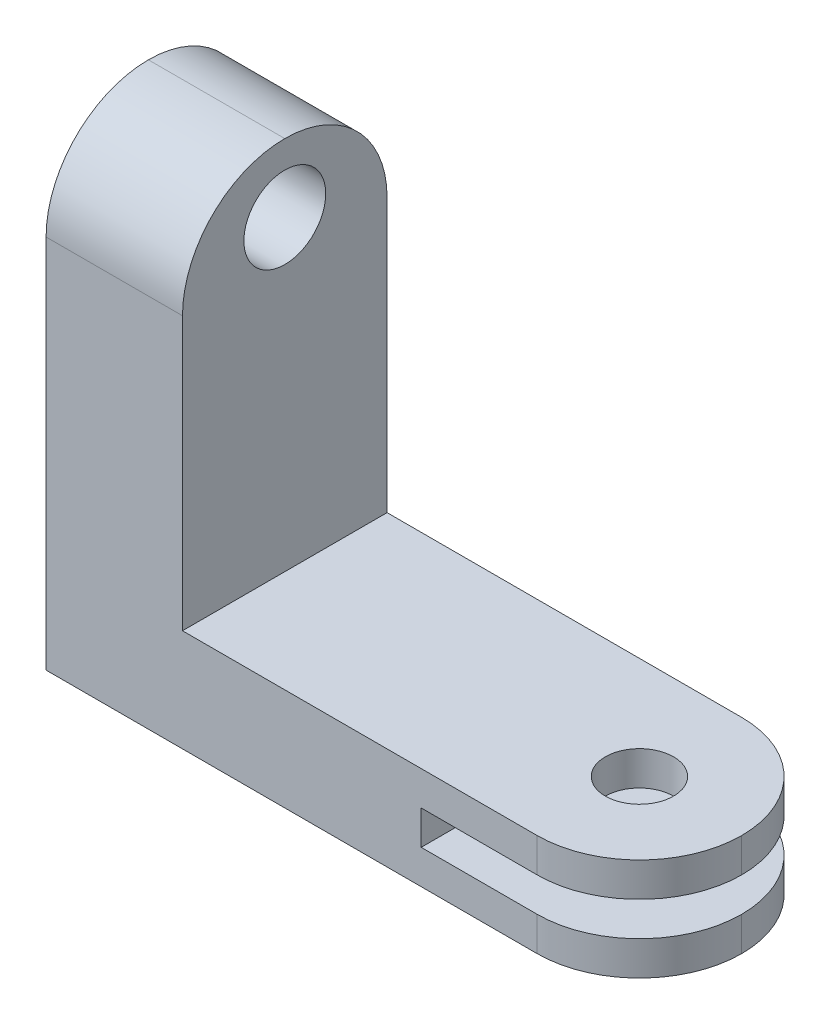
ISO-10303-21;
HEADER;
FILE_DESCRIPTION(('STEP AP214'),'2;1');
FILE_NAME('part.step','',(''),(''),'','','');
FILE_SCHEMA(('AUTOMOTIVE_DESIGN { 1 0 10303 214 1 1 1 1 }'));
ENDSEC;
DATA;
#1=APPLICATION_CONTEXT('core data for automotive mechanical design processes');
#2=APPLICATION_PROTOCOL_DEFINITION('international standard','automotive_design',2000,#1);
#3=PRODUCT_CONTEXT('',#1,'mechanical');
#4=PRODUCT('Part','Part','',(#3));
#5=PRODUCT_RELATED_PRODUCT_CATEGORY('part','',(#4));
#6=PRODUCT_DEFINITION_FORMATION('','',#4);
#7=PRODUCT_DEFINITION_CONTEXT('part definition',#1,'design');
#8=PRODUCT_DEFINITION('design','',#6,#7);
#9=PRODUCT_DEFINITION_SHAPE('','',#8);
#10=(LENGTH_UNIT() NAMED_UNIT(*) SI_UNIT(.MILLI.,.METRE.));
#11=(NAMED_UNIT(*) PLANE_ANGLE_UNIT() SI_UNIT($,.RADIAN.));
#12=(NAMED_UNIT(*) SI_UNIT($,.STERADIAN.) SOLID_ANGLE_UNIT());
#13=UNCERTAINTY_MEASURE_WITH_UNIT(LENGTH_MEASURE(1.E-05),#10,'distance_accuracy_value','');
#14=(GEOMETRIC_REPRESENTATION_CONTEXT(3) GLOBAL_UNCERTAINTY_ASSIGNED_CONTEXT((#13)) GLOBAL_UNIT_ASSIGNED_CONTEXT((#10,
#11,#12)) REPRESENTATION_CONTEXT('',''));
#15=CARTESIAN_POINT('',(0.,0.,0.));
#16=DIRECTION('',(0.,0.,1.));
#17=DIRECTION('',(1.,0.,0.));
#18=AXIS2_PLACEMENT_3D('',#15,#16,#17);
#19=CARTESIAN_POINT('',(72.,0.,15.));
#20=DIRECTION('',(0.,1.,0.));
#21=DIRECTION('',(0.,0.,1.));
#22=AXIS2_PLACEMENT_3D('',#19,#20,#21);
#23=CYLINDRICAL_SURFACE('',#22,15.);
#24=DIRECTION('',(0.,1.,0.));
#25=VECTOR('',#24,1.);
#26=CARTESIAN_POINT('',(87.,0.,15.));
#27=LINE('',#26,#25);
#28=CARTESIAN_POINT('',(87.,10.,15.));
#29=VERTEX_POINT('',#28);
#30=CARTESIAN_POINT('',(87.,15.,15.));
#31=VERTEX_POINT('',#30);
#32=EDGE_CURVE('E173',#29,#31,#27,.T.);
#33=ORIENTED_EDGE('',*,*,#32,.F.);
#34=CARTESIAN_POINT('',(72.,10.,15.));
#35=DIRECTION('',(0.,-1.,0.));
#36=DIRECTION('',(1.,0.,0.));
#37=AXIS2_PLACEMENT_3D('',#34,#35,#36);
#38=CIRCLE('',#37,15.);
#39=CARTESIAN_POINT('',(72.,10.,0.));
#40=VERTEX_POINT('',#39);
#41=EDGE_CURVE('E43',#29,#40,#38,.F.);
#42=ORIENTED_EDGE('',*,*,#41,.T.);
#43=DIRECTION('',(0.,1.,0.));
#44=VECTOR('',#43,1.);
#45=CARTESIAN_POINT('',(72.,0.,0.));
#46=LINE('',#45,#44);
#47=CARTESIAN_POINT('',(72.,15.,0.));
#48=VERTEX_POINT('',#47);
#49=EDGE_CURVE('E215',#48,#40,#46,.F.);
#50=ORIENTED_EDGE('',*,*,#49,.F.);
#51=CARTESIAN_POINT('',(72.,15.,15.));
#52=DIRECTION('',(0.,-1.,0.));
#53=DIRECTION('',(1.,0.,0.));
#54=AXIS2_PLACEMENT_3D('',#51,#52,#53);
#55=CIRCLE('',#54,15.);
#56=EDGE_CURVE('E205',#31,#48,#55,.F.);
#57=ORIENTED_EDGE('',*,*,#56,.F.);
#58=EDGE_LOOP('',(#33,#42,#50,#57));
#59=FACE_BOUND('',#58,.T.);
#60=ADVANCED_FACE('F26',(#59),#23,.T.);
#61=CARTESIAN_POINT('',(72.,0.,15.));
#62=DIRECTION('',(0.,-1.,0.));
#63=DIRECTION('',(0.,0.,-1.));
#64=AXIS2_PLACEMENT_3D('',#61,#62,#63);
#65=CYLINDRICAL_SURFACE('',#64,15.);
#66=DIRECTION('',(0.,1.,0.));
#67=VECTOR('',#66,1.);
#68=CARTESIAN_POINT('',(72.,15.,30.));
#69=LINE('',#68,#67);
#70=CARTESIAN_POINT('',(72.,10.,30.));
#71=VERTEX_POINT('',#70);
#72=CARTESIAN_POINT('',(72.,15.,30.));
#73=VERTEX_POINT('',#72);
#74=EDGE_CURVE('E202',#71,#73,#69,.T.);
#75=ORIENTED_EDGE('',*,*,#74,.F.);
#76=CARTESIAN_POINT('',(72.,10.,15.));
#77=DIRECTION('',(0.,-1.,0.));
#78=DIRECTION('',(1.,0.,0.));
#79=AXIS2_PLACEMENT_3D('',#76,#77,#78);
#80=CIRCLE('',#79,15.);
#81=EDGE_CURVE('E128',#71,#29,#80,.F.);
#82=ORIENTED_EDGE('',*,*,#81,.T.);
#83=ORIENTED_EDGE('',*,*,#32,.T.);
#84=CARTESIAN_POINT('',(72.,15.,15.));
#85=DIRECTION('',(0.,-1.,0.));
#86=DIRECTION('',(1.,0.,0.));
#87=AXIS2_PLACEMENT_3D('',#84,#85,#86);
#88=CIRCLE('',#87,15.);
#89=EDGE_CURVE('E207',#73,#31,#88,.F.);
#90=ORIENTED_EDGE('',*,*,#89,.F.);
#91=EDGE_LOOP('',(#75,#82,#83,#90));
#92=FACE_BOUND('',#91,.T.);
#93=ADVANCED_FACE('F231',(#92),#65,.T.);
#94=CARTESIAN_POINT('',(72.,0.,15.));
#95=DIRECTION('',(0.,1.,0.));
#96=DIRECTION('',(-1.,0.,0.));
#97=AXIS2_PLACEMENT_3D('',#94,#95,#96);
#98=CYLINDRICAL_SURFACE('',#97,5.);
#99=CARTESIAN_POINT('',(72.,15.,15.));
#100=DIRECTION('',(0.,1.,0.));
#101=DIRECTION('',(-1.,0.,0.));
#102=AXIS2_PLACEMENT_3D('',#99,#100,#101);
#103=CIRCLE('',#102,5.);
#104=CARTESIAN_POINT('',(67.,15.,15.));
#105=VERTEX_POINT('',#104);
#106=EDGE_CURVE('E161',#105,#105,#103,.T.);
#107=CARTESIAN_POINT('',(72.,10.,15.));
#108=DIRECTION('',(0.,-1.,0.));
#109=DIRECTION('',(1.,0.,0.));
#110=AXIS2_PLACEMENT_3D('',#107,#108,#109);
#111=CIRCLE('',#110,5.);
#112=CARTESIAN_POINT('',(67.,10.,15.));
#113=VERTEX_POINT('',#112);
#114=EDGE_CURVE('E148',#113,#113,#111,.F.);
#115=CARTESIAN_POINT('',(67.,15.,15.));
#116=CARTESIAN_POINT('',(67.,14.9479166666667,15.));
#117=CARTESIAN_POINT('',(67.,14.8958333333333,15.));
#118=CARTESIAN_POINT('',(67.,14.7916666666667,15.));
#119=CARTESIAN_POINT('',(67.,14.7395833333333,15.));
#120=CARTESIAN_POINT('',(67.,14.6354166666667,15.));
#121=CARTESIAN_POINT('',(67.,14.5833333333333,15.));
#122=CARTESIAN_POINT('',(67.,14.4791666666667,15.));
#123=CARTESIAN_POINT('',(67.,14.4270833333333,15.));
#124=CARTESIAN_POINT('',(67.,14.3229166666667,15.));
#125=CARTESIAN_POINT('',(67.,14.2708333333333,15.));
#126=CARTESIAN_POINT('',(67.,14.1666666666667,15.));
#127=CARTESIAN_POINT('',(67.,14.1145833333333,15.));
#128=CARTESIAN_POINT('',(67.,14.0104166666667,15.));
#129=CARTESIAN_POINT('',(67.,13.9583333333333,15.));
#130=CARTESIAN_POINT('',(67.,13.8541666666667,15.));
#131=CARTESIAN_POINT('',(67.,13.8020833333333,15.));
#132=CARTESIAN_POINT('',(67.,13.6979166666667,15.));
#133=CARTESIAN_POINT('',(67.,13.6458333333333,15.));
#134=CARTESIAN_POINT('',(67.,13.5416666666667,15.));
#135=CARTESIAN_POINT('',(67.,13.4895833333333,15.));
#136=CARTESIAN_POINT('',(67.,13.3854166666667,15.));
#137=CARTESIAN_POINT('',(67.,13.3333333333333,15.));
#138=CARTESIAN_POINT('',(67.,13.2291666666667,15.));
#139=CARTESIAN_POINT('',(67.,13.1770833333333,15.));
#140=CARTESIAN_POINT('',(67.,13.0729166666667,15.));
#141=CARTESIAN_POINT('',(67.,13.0208333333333,15.));
#142=CARTESIAN_POINT('',(67.,12.9166666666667,15.));
#143=CARTESIAN_POINT('',(67.,12.8645833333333,15.));
#144=CARTESIAN_POINT('',(67.,12.7604166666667,15.));
#145=CARTESIAN_POINT('',(67.,12.7083333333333,15.));
#146=CARTESIAN_POINT('',(67.,12.6041666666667,15.));
#147=CARTESIAN_POINT('',(67.,12.5520833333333,15.));
#148=CARTESIAN_POINT('',(67.,12.4479166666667,15.));
#149=CARTESIAN_POINT('',(67.,12.3958333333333,15.));
#150=CARTESIAN_POINT('',(67.,12.2916666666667,15.));
#151=CARTESIAN_POINT('',(67.,12.2395833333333,15.));
#152=CARTESIAN_POINT('',(67.,12.1354166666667,15.));
#153=CARTESIAN_POINT('',(67.,12.0833333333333,15.));
#154=CARTESIAN_POINT('',(67.,11.9791666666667,15.));
#155=CARTESIAN_POINT('',(67.,11.9270833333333,15.));
#156=CARTESIAN_POINT('',(67.,11.8229166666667,15.));
#157=CARTESIAN_POINT('',(67.,11.7708333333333,15.));
#158=CARTESIAN_POINT('',(67.,11.6666666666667,15.));
#159=CARTESIAN_POINT('',(67.,11.6145833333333,15.));
#160=CARTESIAN_POINT('',(67.,11.5104166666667,15.));
#161=CARTESIAN_POINT('',(67.,11.4583333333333,15.));
#162=CARTESIAN_POINT('',(67.,11.3541666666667,15.));
#163=CARTESIAN_POINT('',(67.,11.3020833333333,15.));
#164=CARTESIAN_POINT('',(67.,11.1979166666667,15.));
#165=CARTESIAN_POINT('',(67.,11.1458333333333,15.));
#166=CARTESIAN_POINT('',(67.,11.0416666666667,15.));
#167=CARTESIAN_POINT('',(67.,10.9895833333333,15.));
#168=CARTESIAN_POINT('',(67.,10.8854166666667,15.));
#169=CARTESIAN_POINT('',(67.,10.8333333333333,15.));
#170=CARTESIAN_POINT('',(67.,10.7291666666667,15.));
#171=CARTESIAN_POINT('',(67.,10.6770833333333,15.));
#172=CARTESIAN_POINT('',(67.,10.5729166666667,15.));
#173=CARTESIAN_POINT('',(67.,10.5208333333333,15.));
#174=CARTESIAN_POINT('',(67.,10.4166666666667,15.));
#175=CARTESIAN_POINT('',(67.,10.3645833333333,15.));
#176=CARTESIAN_POINT('',(67.,10.2604166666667,15.));
#177=CARTESIAN_POINT('',(67.,10.2083333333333,15.));
#178=CARTESIAN_POINT('',(67.,10.1041666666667,15.));
#179=CARTESIAN_POINT('',(67.,10.0520833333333,15.));
#180=CARTESIAN_POINT('',(67.,10.,15.));
#181=B_SPLINE_CURVE_WITH_KNOTS('',3,(#115,#116,#117,#118,#119,#120,#121,#122,#123,#124,#125,
#126,#127,#128,#129,#130,#131,#132,#133,#134,#135,#136,#137,#138,#139,#140,#141,#142,#143,#144,
#145,#146,#147,#148,#149,#150,#151,#152,#153,#154,#155,#156,#157,#158,#159,#160,#161,#162,#163,
#164,#165,#166,#167,#168,#169,#170,#171,#172,#173,#174,#175,#176,#177,#178,#179,#180),
.UNSPECIFIED.,.F.,.F.,(4,2,2,2,2,2,2,2,2,2,2,2,2,2,2,2,2,2,2,2,2,2,2,2,2,2,2,2,2,2,2,2,4),(0.,
0.15625,0.3125,0.46875,0.625000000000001,0.781250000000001,0.937500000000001,1.09375,1.25,
1.40625,1.5625,1.71875,1.875,2.03125,2.1875,2.34375,2.5,2.65625,2.8125,2.96875,3.125,3.28125,
3.4375,3.59375,3.75,3.90625,4.0625,4.21875,4.375,4.53125,4.6875,4.84375,5.),.UNSPECIFIED.);
#182=EDGE_CURVE('BSEAM229',#105,#113,#181,.T.);
#183=ORIENTED_EDGE('',*,*,#106,.T.);
#184=ORIENTED_EDGE('',*,*,#114,.F.);
#185=ORIENTED_EDGE('',*,*,#182,.T.);
#186=ORIENTED_EDGE('',*,*,#182,.F.);
#187=EDGE_LOOP('',(#183,#185,#184,#186));
#188=FACE_BOUND('',#187,.T.);
#189=ADVANCED_FACE('F229',(#188),#98,.F.);
#190=CARTESIAN_POINT('',(0.,70.,30.));
#191=DIRECTION('',(1.,0.,0.));
#192=DIRECTION('',(0.,1.,0.));
#193=AXIS2_PLACEMENT_3D('',#190,#191,#192);
#194=PLANE('',#193);
#195=CARTESIAN_POINT('',(0.,60.,15.));
#196=DIRECTION('',(1.,0.,0.));
#197=DIRECTION('',(0.,0.,-1.));
#198=AXIS2_PLACEMENT_3D('',#195,#196,#197);
#199=CIRCLE('',#198,6.);
#200=CARTESIAN_POINT('',(0.,60.,9.00000000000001));
#201=VERTEX_POINT('',#200);
#202=EDGE_CURVE('E170',#201,#201,#199,.T.);
#203=ORIENTED_EDGE('',*,*,#202,.T.);
#204=EDGE_LOOP('',(#203));
#205=FACE_BOUND('',#204,.T.);
#206=DIRECTION('',(0.,-1.,0.));
#207=VECTOR('',#206,1.);
#208=CARTESIAN_POINT('',(0.,70.,30.));
#209=LINE('',#208,#207);
#210=CARTESIAN_POINT('',(0.,55.,30.));
#211=VERTEX_POINT('',#210);
#212=CARTESIAN_POINT('',(0.,0.,30.));
#213=VERTEX_POINT('',#212);
#214=EDGE_CURVE('E186',#211,#213,#209,.T.);
#215=ORIENTED_EDGE('',*,*,#214,.F.);
#216=CARTESIAN_POINT('',(0.,55.,15.));
#217=DIRECTION('',(1.,0.,0.));
#218=DIRECTION('',(0.,1.,0.));
#219=AXIS2_PLACEMENT_3D('',#216,#217,#218);
#220=CIRCLE('',#219,15.);
#221=CARTESIAN_POINT('',(0.,70.,15.));
#222=VERTEX_POINT('',#221);
#223=EDGE_CURVE('E223',#211,#222,#220,.F.);
#224=ORIENTED_EDGE('',*,*,#223,.T.);
#225=CARTESIAN_POINT('',(0.,55.,15.));
#226=DIRECTION('',(1.,0.,0.));
#227=DIRECTION('',(0.,1.,0.));
#228=AXIS2_PLACEMENT_3D('',#225,#226,#227);
#229=CIRCLE('',#228,15.);
#230=CARTESIAN_POINT('',(0.,55.,0.));
#231=VERTEX_POINT('',#230);
#232=EDGE_CURVE('E221',#222,#231,#229,.F.);
#233=ORIENTED_EDGE('',*,*,#232,.T.);
#234=DIRECTION('',(0.,-1.,0.));
#235=VECTOR('',#234,1.);
#236=CARTESIAN_POINT('',(0.,70.,0.));
#237=LINE('',#236,#235);
#238=CARTESIAN_POINT('',(0.,0.,0.));
#239=VERTEX_POINT('',#238);
#240=EDGE_CURVE('E177',#231,#239,#237,.T.);
#241=ORIENTED_EDGE('',*,*,#240,.T.);
#242=DIRECTION('',(0.,0.,-1.));
#243=VECTOR('',#242,1.);
#244=CARTESIAN_POINT('',(0.,0.,30.));
#245=LINE('',#244,#243);
#246=EDGE_CURVE('E199',#213,#239,#245,.T.);
#247=ORIENTED_EDGE('',*,*,#246,.F.);
#248=EDGE_LOOP('',(#215,#224,#233,#241,#247));
#249=FACE_BOUND('',#248,.T.);
#250=ADVANCED_FACE('F28',(#205,#249),#194,.F.);
#251=CARTESIAN_POINT('',(0.,0.,30.));
#252=DIRECTION('',(0.,1.,0.));
#253=DIRECTION('',(0.,0.,1.));
#254=AXIS2_PLACEMENT_3D('',#251,#252,#253);
#255=PLANE('',#254);
#256=CARTESIAN_POINT('',(72.,0.,15.));
#257=DIRECTION('',(0.,1.,0.));
#258=DIRECTION('',(-1.,0.,0.));
#259=AXIS2_PLACEMENT_3D('',#256,#257,#258);
#260=CIRCLE('',#259,5.);
#261=CARTESIAN_POINT('',(67.,0.,15.));
#262=VERTEX_POINT('',#261);
#263=EDGE_CURVE('E164',#262,#262,#260,.T.);
#264=ORIENTED_EDGE('',*,*,#263,.T.);
#265=EDGE_LOOP('',(#264));
#266=FACE_BOUND('',#265,.T.);
#267=CARTESIAN_POINT('',(72.,0.,15.));
#268=DIRECTION('',(0.,1.,0.));
#269=DIRECTION('',(0.,0.,1.));
#270=AXIS2_PLACEMENT_3D('',#267,#268,#269);
#271=CIRCLE('',#270,15.);
#272=CARTESIAN_POINT('',(72.,0.,0.));
#273=VERTEX_POINT('',#272);
#274=CARTESIAN_POINT('',(87.,0.,15.));
#275=VERTEX_POINT('',#274);
#276=EDGE_CURVE('E210',#273,#275,#271,.F.);
#277=ORIENTED_EDGE('',*,*,#276,.T.);
#278=CARTESIAN_POINT('',(72.,0.,15.));
#279=DIRECTION('',(0.,1.,0.));
#280=DIRECTION('',(0.,0.,1.));
#281=AXIS2_PLACEMENT_3D('',#278,#279,#280);
#282=CIRCLE('',#281,15.);
#283=CARTESIAN_POINT('',(72.,0.,30.));
#284=VERTEX_POINT('',#283);
#285=EDGE_CURVE('E212',#275,#284,#282,.F.);
#286=ORIENTED_EDGE('',*,*,#285,.T.);
#287=DIRECTION('',(1.,0.,0.));
#288=VECTOR('',#287,1.);
#289=CARTESIAN_POINT('',(0.,0.,30.));
#290=LINE('',#289,#288);
#291=EDGE_CURVE('E188',#213,#284,#290,.T.);
#292=ORIENTED_EDGE('',*,*,#291,.F.);
#293=ORIENTED_EDGE('',*,*,#246,.T.);
#294=DIRECTION('',(1.,0.,0.));
#295=VECTOR('',#294,1.);
#296=CARTESIAN_POINT('',(0.,0.,0.));
#297=LINE('',#296,#295);
#298=EDGE_CURVE('E179',#239,#273,#297,.T.);
#299=ORIENTED_EDGE('',*,*,#298,.T.);
#300=EDGE_LOOP('',(#277,#286,#292,#293,#299));
#301=FACE_BOUND('',#300,.T.);
#302=ADVANCED_FACE('F240',(#266,#301),#255,.F.);
#303=CARTESIAN_POINT('',(87.,15.,30.));
#304=DIRECTION('',(0.,-1.,0.));
#305=DIRECTION('',(1.,0.,0.));
#306=AXIS2_PLACEMENT_3D('',#303,#304,#305);
#307=PLANE('',#306);
#308=ORIENTED_EDGE('',*,*,#106,.F.);
#309=EDGE_LOOP('',(#308));
#310=FACE_BOUND('',#309,.T.);
#311=DIRECTION('',(-1.,0.,0.));
#312=VECTOR('',#311,1.);
#313=CARTESIAN_POINT('',(87.,15.,30.));
#314=LINE('',#313,#312);
#315=CARTESIAN_POINT('',(20.,15.,30.));
#316=VERTEX_POINT('',#315);
#317=EDGE_CURVE('E191',#73,#316,#314,.T.);
#318=ORIENTED_EDGE('',*,*,#317,.F.);
#319=ORIENTED_EDGE('',*,*,#89,.T.);
#320=ORIENTED_EDGE('',*,*,#56,.T.);
#321=DIRECTION('',(-1.,0.,0.));
#322=VECTOR('',#321,1.);
#323=CARTESIAN_POINT('',(87.,15.,0.));
#324=LINE('',#323,#322);
#325=CARTESIAN_POINT('',(20.,15.,0.));
#326=VERTEX_POINT('',#325);
#327=EDGE_CURVE('E182',#48,#326,#324,.T.);
#328=ORIENTED_EDGE('',*,*,#327,.T.);
#329=DIRECTION('',(0.,0.,-1.));
#330=VECTOR('',#329,1.);
#331=CARTESIAN_POINT('',(20.,15.,30.));
#332=LINE('',#331,#330);
#333=EDGE_CURVE('E196',#316,#326,#332,.T.);
#334=ORIENTED_EDGE('',*,*,#333,.F.);
#335=EDGE_LOOP('',(#318,#319,#320,#328,#334));
#336=FACE_BOUND('',#335,.T.);
#337=ADVANCED_FACE('F300',(#310,#336),#307,.F.);
#338=CARTESIAN_POINT('',(20.,15.,30.));
#339=DIRECTION('',(-1.,0.,0.));
#340=DIRECTION('',(0.,0.,1.));
#341=AXIS2_PLACEMENT_3D('',#338,#339,#340);
#342=PLANE('',#341);
#343=CARTESIAN_POINT('',(20.,60.,15.));
#344=DIRECTION('',(1.,0.,0.));
#345=DIRECTION('',(0.,0.,-1.));
#346=AXIS2_PLACEMENT_3D('',#343,#344,#345);
#347=CIRCLE('',#346,6.);
#348=CARTESIAN_POINT('',(20.,60.,9.00000000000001));
#349=VERTEX_POINT('',#348);
#350=EDGE_CURVE('E167',#349,#349,#347,.T.);
#351=ORIENTED_EDGE('',*,*,#350,.F.);
#352=EDGE_LOOP('',(#351));
#353=FACE_BOUND('',#352,.T.);
#354=CARTESIAN_POINT('',(20.,55.,15.));
#355=DIRECTION('',(-1.,0.,0.));
#356=DIRECTION('',(0.,0.,1.));
#357=AXIS2_PLACEMENT_3D('',#354,#355,#356);
#358=CIRCLE('',#357,15.);
#359=CARTESIAN_POINT('',(20.,55.,0.));
#360=VERTEX_POINT('',#359);
#361=CARTESIAN_POINT('',(20.,70.,15.));
#362=VERTEX_POINT('',#361);
#363=EDGE_CURVE('E51',#360,#362,#358,.F.);
#364=ORIENTED_EDGE('',*,*,#363,.T.);
#365=CARTESIAN_POINT('',(20.,55.,15.));
#366=DIRECTION('',(-1.,0.,0.));
#367=DIRECTION('',(0.,0.,1.));
#368=AXIS2_PLACEMENT_3D('',#365,#366,#367);
#369=CIRCLE('',#368,15.);
#370=CARTESIAN_POINT('',(20.,55.,30.));
#371=VERTEX_POINT('',#370);
#372=EDGE_CURVE('E35',#362,#371,#369,.F.);
#373=ORIENTED_EDGE('',*,*,#372,.T.);
#374=DIRECTION('',(0.,1.,0.));
#375=VECTOR('',#374,1.);
#376=CARTESIAN_POINT('',(20.,15.,30.));
#377=LINE('',#376,#375);
#378=EDGE_CURVE('E193',#316,#371,#377,.T.);
#379=ORIENTED_EDGE('',*,*,#378,.F.);
#380=ORIENTED_EDGE('',*,*,#333,.T.);
#381=DIRECTION('',(0.,1.,0.));
#382=VECTOR('',#381,1.);
#383=CARTESIAN_POINT('',(20.,15.,0.));
#384=LINE('',#383,#382);
#385=EDGE_CURVE('E184',#326,#360,#384,.T.);
#386=ORIENTED_EDGE('',*,*,#385,.T.);
#387=EDGE_LOOP('',(#364,#373,#379,#380,#386));
#388=FACE_BOUND('',#387,.T.);
#389=ADVANCED_FACE('F308',(#353,#388),#342,.F.);
#390=CARTESIAN_POINT('',(0.,0.,30.));
#391=DIRECTION('',(0.,0.,1.));
#392=DIRECTION('',(1.,0.,0.));
#393=AXIS2_PLACEMENT_3D('',#390,#391,#392);
#394=PLANE('',#393);
#395=DIRECTION('',(1.,0.,0.));
#396=VECTOR('',#395,1.);
#397=CARTESIAN_POINT('',(55.0000000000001,5.,30.));
#398=LINE('',#397,#396);
#399=CARTESIAN_POINT('',(55.0000000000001,5.,30.));
#400=VERTEX_POINT('',#399);
#401=CARTESIAN_POINT('',(72.,5.,30.));
#402=VERTEX_POINT('',#401);
#403=EDGE_CURVE('E145',#400,#402,#398,.T.);
#404=ORIENTED_EDGE('',*,*,#403,.F.);
#405=DIRECTION('',(0.,1.,0.));
#406=VECTOR('',#405,1.);
#407=CARTESIAN_POINT('',(55.0000000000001,5.,30.));
#408=LINE('',#407,#406);
#409=CARTESIAN_POINT('',(55.0000000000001,10.,30.));
#410=VERTEX_POINT('',#409);
#411=EDGE_CURVE('E137',#400,#410,#408,.T.);
#412=ORIENTED_EDGE('',*,*,#411,.T.);
#413=DIRECTION('',(1.,0.,0.));
#414=VECTOR('',#413,1.);
#415=CARTESIAN_POINT('',(55.0000000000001,10.,30.));
#416=LINE('',#415,#414);
#417=EDGE_CURVE('E122',#410,#71,#416,.T.);
#418=ORIENTED_EDGE('',*,*,#417,.T.);
#419=ORIENTED_EDGE('',*,*,#74,.T.);
#420=ORIENTED_EDGE('',*,*,#317,.T.);
#421=ORIENTED_EDGE('',*,*,#378,.T.);
#422=DIRECTION('',(-1.,0.,0.));
#423=VECTOR('',#422,1.);
#424=CARTESIAN_POINT('',(0.,55.,30.));
#425=LINE('',#424,#423);
#426=EDGE_CURVE('E218',#371,#211,#425,.T.);
#427=ORIENTED_EDGE('',*,*,#426,.T.);
#428=ORIENTED_EDGE('',*,*,#214,.T.);
#429=ORIENTED_EDGE('',*,*,#291,.T.);
#430=EDGE_CURVE('E203',#284,#402,#69,.T.);
#431=ORIENTED_EDGE('',*,*,#430,.T.);
#432=EDGE_LOOP('',(#404,#412,#418,#419,#420,#421,#427,#428,#429,#431));
#433=FACE_BOUND('',#432,.T.);
#434=ADVANCED_FACE('F143',(#433),#394,.T.);
#435=CARTESIAN_POINT('',(0.,0.,0.));
#436=DIRECTION('',(0.,0.,1.));
#437=DIRECTION('',(1.,0.,0.));
#438=AXIS2_PLACEMENT_3D('',#435,#436,#437);
#439=PLANE('',#438);
#440=DIRECTION('',(0.,1.,0.));
#441=VECTOR('',#440,1.);
#442=CARTESIAN_POINT('',(55.0000000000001,5.,0.));
#443=LINE('',#442,#441);
#444=CARTESIAN_POINT('',(55.0000000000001,5.,0.));
#445=VERTEX_POINT('',#444);
#446=CARTESIAN_POINT('',(55.0000000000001,10.,0.));
#447=VERTEX_POINT('',#446);
#448=EDGE_CURVE('E140',#445,#447,#443,.T.);
#449=ORIENTED_EDGE('',*,*,#448,.F.);
#450=DIRECTION('',(-1.,0.,0.));
#451=VECTOR('',#450,1.);
#452=CARTESIAN_POINT('',(55.0000000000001,5.,0.));
#453=LINE('',#452,#451);
#454=CARTESIAN_POINT('',(72.,5.,0.));
#455=VERTEX_POINT('',#454);
#456=EDGE_CURVE('E146',#455,#445,#453,.T.);
#457=ORIENTED_EDGE('',*,*,#456,.F.);
#458=EDGE_CURVE('E214',#455,#273,#46,.F.);
#459=ORIENTED_EDGE('',*,*,#458,.T.);
#460=ORIENTED_EDGE('',*,*,#298,.F.);
#461=ORIENTED_EDGE('',*,*,#240,.F.);
#462=DIRECTION('',(-1.,0.,0.));
#463=VECTOR('',#462,1.);
#464=CARTESIAN_POINT('',(0.,55.,0.));
#465=LINE('',#464,#463);
#466=EDGE_CURVE('E11',#231,#360,#465,.F.);
#467=ORIENTED_EDGE('',*,*,#466,.T.);
#468=ORIENTED_EDGE('',*,*,#385,.F.);
#469=ORIENTED_EDGE('',*,*,#327,.F.);
#470=ORIENTED_EDGE('',*,*,#49,.T.);
#471=DIRECTION('',(-1.,0.,0.));
#472=VECTOR('',#471,1.);
#473=CARTESIAN_POINT('',(55.0000000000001,10.,0.));
#474=LINE('',#473,#472);
#475=EDGE_CURVE('E132',#40,#447,#474,.T.);
#476=ORIENTED_EDGE('',*,*,#475,.T.);
#477=EDGE_LOOP('',(#449,#457,#459,#460,#461,#467,#468,#469,#470,#476));
#478=FACE_BOUND('',#477,.T.);
#479=ADVANCED_FACE('F261',(#478),#439,.F.);
#480=CARTESIAN_POINT('',(72.,5.,15.));
#481=DIRECTION('',(0.,-1.,0.));
#482=DIRECTION('',(1.,0.,0.));
#483=AXIS2_PLACEMENT_3D('',#480,#481,#482);
#484=CIRCLE('',#483,15.);
#485=CARTESIAN_POINT('',(87.,5.,15.));
#486=VERTEX_POINT('',#485);
#487=EDGE_CURVE('E156',#486,#455,#484,.F.);
#488=ORIENTED_EDGE('',*,*,#487,.F.);
#489=EDGE_CURVE('E174',#275,#486,#27,.T.);
#490=ORIENTED_EDGE('',*,*,#489,.F.);
#491=ORIENTED_EDGE('',*,*,#276,.F.);
#492=ORIENTED_EDGE('',*,*,#458,.F.);
#493=EDGE_LOOP('',(#488,#490,#491,#492));
#494=FACE_BOUND('',#493,.T.);
#495=ADVANCED_FACE('F254',(#494),#23,.T.);
#496=CARTESIAN_POINT('',(72.,5.,15.));
#497=DIRECTION('',(0.,-1.,0.));
#498=DIRECTION('',(1.,0.,0.));
#499=AXIS2_PLACEMENT_3D('',#496,#497,#498);
#500=CIRCLE('',#499,15.);
#501=EDGE_CURVE('E154',#402,#486,#500,.F.);
#502=ORIENTED_EDGE('',*,*,#501,.F.);
#503=ORIENTED_EDGE('',*,*,#430,.F.);
#504=ORIENTED_EDGE('',*,*,#285,.F.);
#505=ORIENTED_EDGE('',*,*,#489,.T.);
#506=EDGE_LOOP('',(#502,#503,#504,#505));
#507=FACE_BOUND('',#506,.T.);
#508=ADVANCED_FACE('F244',(#507),#65,.T.);
#509=CARTESIAN_POINT('',(0.,60.,15.));
#510=DIRECTION('',(1.,0.,0.));
#511=DIRECTION('',(0.,0.,-1.));
#512=AXIS2_PLACEMENT_3D('',#509,#510,#511);
#513=CYLINDRICAL_SURFACE('',#512,6.);
#514=ORIENTED_EDGE('',*,*,#202,.F.);
#515=EDGE_LOOP('',(#514));
#516=FACE_BOUND('',#515,.T.);
#517=ORIENTED_EDGE('',*,*,#350,.T.);
#518=EDGE_LOOP('',(#517));
#519=FACE_BOUND('',#518,.T.);
#520=ADVANCED_FACE('F249',(#516,#519),#513,.F.);
#521=CARTESIAN_POINT('',(72.,5.,15.));
#522=DIRECTION('',(0.,-1.,0.));
#523=DIRECTION('',(1.,0.,0.));
#524=AXIS2_PLACEMENT_3D('',#521,#522,#523);
#525=CIRCLE('',#524,5.);
#526=CARTESIAN_POINT('',(67.,5.,15.));
#527=VERTEX_POINT('',#526);
#528=EDGE_CURVE('E30',#527,#527,#525,.F.);
#529=CARTESIAN_POINT('',(67.,5.,15.));
#530=CARTESIAN_POINT('',(67.,4.94791666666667,15.));
#531=CARTESIAN_POINT('',(67.,4.89583333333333,15.));
#532=CARTESIAN_POINT('',(67.,4.79166666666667,15.));
#533=CARTESIAN_POINT('',(67.,4.73958333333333,15.));
#534=CARTESIAN_POINT('',(67.,4.63541666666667,15.));
#535=CARTESIAN_POINT('',(67.,4.58333333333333,15.));
#536=CARTESIAN_POINT('',(67.,4.47916666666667,15.));
#537=CARTESIAN_POINT('',(67.,4.42708333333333,15.));
#538=CARTESIAN_POINT('',(67.,4.32291666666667,15.));
#539=CARTESIAN_POINT('',(67.,4.27083333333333,15.));
#540=CARTESIAN_POINT('',(67.,4.16666666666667,15.));
#541=CARTESIAN_POINT('',(67.,4.11458333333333,15.));
#542=CARTESIAN_POINT('',(67.,4.01041666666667,15.));
#543=CARTESIAN_POINT('',(67.,3.95833333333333,15.));
#544=CARTESIAN_POINT('',(67.,3.85416666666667,15.));
#545=CARTESIAN_POINT('',(67.,3.80208333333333,15.));
#546=CARTESIAN_POINT('',(67.,3.69791666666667,15.));
#547=CARTESIAN_POINT('',(67.,3.64583333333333,15.));
#548=CARTESIAN_POINT('',(67.,3.54166666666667,15.));
#549=CARTESIAN_POINT('',(67.,3.48958333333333,15.));
#550=CARTESIAN_POINT('',(67.,3.38541666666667,15.));
#551=CARTESIAN_POINT('',(67.,3.33333333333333,15.));
#552=CARTESIAN_POINT('',(67.,3.22916666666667,15.));
#553=CARTESIAN_POINT('',(67.,3.17708333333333,15.));
#554=CARTESIAN_POINT('',(67.,3.07291666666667,15.));
#555=CARTESIAN_POINT('',(67.,3.02083333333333,15.));
#556=CARTESIAN_POINT('',(67.,2.91666666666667,15.));
#557=CARTESIAN_POINT('',(67.,2.86458333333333,15.));
#558=CARTESIAN_POINT('',(67.,2.76041666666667,15.));
#559=CARTESIAN_POINT('',(67.,2.70833333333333,15.));
#560=CARTESIAN_POINT('',(67.,2.60416666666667,15.));
#561=CARTESIAN_POINT('',(67.,2.55208333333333,15.));
#562=CARTESIAN_POINT('',(67.,2.44791666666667,15.));
#563=CARTESIAN_POINT('',(67.,2.39583333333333,15.));
#564=CARTESIAN_POINT('',(67.,2.29166666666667,15.));
#565=CARTESIAN_POINT('',(67.,2.23958333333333,15.));
#566=CARTESIAN_POINT('',(67.,2.13541666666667,15.));
#567=CARTESIAN_POINT('',(67.,2.08333333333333,15.));
#568=CARTESIAN_POINT('',(67.,1.97916666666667,15.));
#569=CARTESIAN_POINT('',(67.,1.92708333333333,15.));
#570=CARTESIAN_POINT('',(67.,1.82291666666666,15.));
#571=CARTESIAN_POINT('',(67.,1.77083333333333,15.));
#572=CARTESIAN_POINT('',(67.,1.66666666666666,15.));
#573=CARTESIAN_POINT('',(67.,1.61458333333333,15.));
#574=CARTESIAN_POINT('',(67.,1.51041666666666,15.));
#575=CARTESIAN_POINT('',(67.,1.45833333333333,15.));
#576=CARTESIAN_POINT('',(67.,1.35416666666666,15.));
#577=CARTESIAN_POINT('',(67.,1.30208333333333,15.));
#578=CARTESIAN_POINT('',(67.,1.19791666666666,15.));
#579=CARTESIAN_POINT('',(67.,1.14583333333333,15.));
#580=CARTESIAN_POINT('',(67.,1.04166666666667,15.));
#581=CARTESIAN_POINT('',(67.,0.989583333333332,15.));
#582=CARTESIAN_POINT('',(67.,0.885416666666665,15.));
#583=CARTESIAN_POINT('',(67.,0.833333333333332,15.));
#584=CARTESIAN_POINT('',(67.,0.729166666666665,15.));
#585=CARTESIAN_POINT('',(67.,0.677083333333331,15.));
#586=CARTESIAN_POINT('',(67.,0.572916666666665,15.));
#587=CARTESIAN_POINT('',(67.,0.520833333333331,15.));
#588=CARTESIAN_POINT('',(67.,0.416666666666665,15.));
#589=CARTESIAN_POINT('',(67.,0.364583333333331,15.));
#590=CARTESIAN_POINT('',(67.,0.260416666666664,15.));
#591=CARTESIAN_POINT('',(67.,0.208333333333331,15.));
#592=CARTESIAN_POINT('',(67.,0.104166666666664,15.));
#593=CARTESIAN_POINT('',(67.,0.052083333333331,15.));
#594=CARTESIAN_POINT('',(67.,0.,15.));
#595=B_SPLINE_CURVE_WITH_KNOTS('',3,(#529,#530,#531,#532,#533,#534,#535,#536,#537,#538,#539,
#540,#541,#542,#543,#544,#545,#546,#547,#548,#549,#550,#551,#552,#553,#554,#555,#556,#557,#558,
#559,#560,#561,#562,#563,#564,#565,#566,#567,#568,#569,#570,#571,#572,#573,#574,#575,#576,#577,
#578,#579,#580,#581,#582,#583,#584,#585,#586,#587,#588,#589,#590,#591,#592,#593,#594),
.UNSPECIFIED.,.F.,.F.,(4,2,2,2,2,2,2,2,2,2,2,2,2,2,2,2,2,2,2,2,2,2,2,2,2,2,2,2,2,2,2,2,4),(0.,
0.15625,0.3125,0.46875,0.625000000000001,0.781250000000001,0.937500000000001,1.09375,1.25,
1.40625,1.5625,1.71875,1.875,2.03125,2.1875,2.34375,2.5,2.65625,2.8125,2.96875,3.125,3.28125,
3.4375,3.59375,3.75,3.90625,4.0625,4.21875,4.375,4.53125,4.6875,4.84375,5.),.UNSPECIFIED.);
#596=EDGE_CURVE('BSEAM234',#527,#262,#595,.T.);
#597=ORIENTED_EDGE('',*,*,#528,.T.);
#598=ORIENTED_EDGE('',*,*,#263,.F.);
#599=ORIENTED_EDGE('',*,*,#596,.T.);
#600=ORIENTED_EDGE('',*,*,#596,.F.);
#601=EDGE_LOOP('',(#597,#599,#598,#600));
#602=FACE_BOUND('',#601,.T.);
#603=ADVANCED_FACE('F234',(#602),#98,.F.);
#604=CARTESIAN_POINT('',(20.,55.,15.));
#605=DIRECTION('',(-1.,0.,0.));
#606=DIRECTION('',(0.,0.,1.));
#607=AXIS2_PLACEMENT_3D('',#604,#605,#606);
#608=CYLINDRICAL_SURFACE('',#607,15.);
#609=DIRECTION('',(-1.,0.,0.));
#610=VECTOR('',#609,1.);
#611=CARTESIAN_POINT('',(20.,70.,15.));
#612=LINE('',#611,#610);
#613=EDGE_CURVE('E158',#362,#222,#612,.T.);
#614=ORIENTED_EDGE('',*,*,#613,.F.);
#615=ORIENTED_EDGE('',*,*,#363,.F.);
#616=ORIENTED_EDGE('',*,*,#466,.F.);
#617=ORIENTED_EDGE('',*,*,#232,.F.);
#618=EDGE_LOOP('',(#614,#615,#616,#617));
#619=FACE_BOUND('',#618,.T.);
#620=ADVANCED_FACE('F248',(#619),#608,.T.);
#621=CARTESIAN_POINT('',(0.,55.,15.));
#622=DIRECTION('',(1.,0.,0.));
#623=DIRECTION('',(0.,0.,-1.));
#624=AXIS2_PLACEMENT_3D('',#621,#622,#623);
#625=CYLINDRICAL_SURFACE('',#624,15.);
#626=ORIENTED_EDGE('',*,*,#372,.F.);
#627=ORIENTED_EDGE('',*,*,#613,.T.);
#628=ORIENTED_EDGE('',*,*,#223,.F.);
#629=ORIENTED_EDGE('',*,*,#426,.F.);
#630=EDGE_LOOP('',(#626,#627,#628,#629));
#631=FACE_BOUND('',#630,.T.);
#632=ADVANCED_FACE('F305',(#631),#625,.T.);
#633=CARTESIAN_POINT('',(55.0000000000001,5.,30.));
#634=DIRECTION('',(0.,-1.,0.));
#635=DIRECTION('',(1.,0.,0.));
#636=AXIS2_PLACEMENT_3D('',#633,#634,#635);
#637=PLANE('',#636);
#638=ORIENTED_EDGE('',*,*,#487,.T.);
#639=ORIENTED_EDGE('',*,*,#456,.T.);
#640=DIRECTION('',(0.,0.,1.));
#641=VECTOR('',#640,1.);
#642=CARTESIAN_POINT('',(55.0000000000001,5.,30.));
#643=LINE('',#642,#641);
#644=EDGE_CURVE('E290',#445,#400,#643,.T.);
#645=ORIENTED_EDGE('',*,*,#644,.T.);
#646=ORIENTED_EDGE('',*,*,#403,.T.);
#647=ORIENTED_EDGE('',*,*,#501,.T.);
#648=EDGE_LOOP('',(#638,#639,#645,#646,#647));
#649=FACE_BOUND('',#648,.T.);
#650=ORIENTED_EDGE('',*,*,#528,.F.);
#651=EDGE_LOOP('',(#650));
#652=FACE_BOUND('',#651,.T.);
#653=ADVANCED_FACE('F288',(#649,#652),#637,.F.);
#654=CARTESIAN_POINT('',(55.0000000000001,10.,30.));
#655=DIRECTION('',(0.,-1.,0.));
#656=DIRECTION('',(1.,0.,0.));
#657=AXIS2_PLACEMENT_3D('',#654,#655,#656);
#658=PLANE('',#657);
#659=ORIENTED_EDGE('',*,*,#81,.F.);
#660=ORIENTED_EDGE('',*,*,#417,.F.);
#661=DIRECTION('',(0.,0.,1.));
#662=VECTOR('',#661,1.);
#663=CARTESIAN_POINT('',(55.0000000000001,10.,30.));
#664=LINE('',#663,#662);
#665=EDGE_CURVE('E126',#447,#410,#664,.T.);
#666=ORIENTED_EDGE('',*,*,#665,.F.);
#667=ORIENTED_EDGE('',*,*,#475,.F.);
#668=ORIENTED_EDGE('',*,*,#41,.F.);
#669=EDGE_LOOP('',(#659,#660,#666,#667,#668));
#670=FACE_BOUND('',#669,.T.);
#671=ORIENTED_EDGE('',*,*,#114,.T.);
#672=EDGE_LOOP('',(#671));
#673=FACE_BOUND('',#672,.T.);
#674=ADVANCED_FACE('F124',(#670,#673),#658,.T.);
#675=CARTESIAN_POINT('',(55.0000000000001,5.,30.));
#676=DIRECTION('',(-1.,0.,0.));
#677=DIRECTION('',(0.,-1.,0.));
#678=AXIS2_PLACEMENT_3D('',#675,#676,#677);
#679=PLANE('',#678);
#680=ORIENTED_EDGE('',*,*,#411,.F.);
#681=ORIENTED_EDGE('',*,*,#644,.F.);
#682=ORIENTED_EDGE('',*,*,#448,.T.);
#683=ORIENTED_EDGE('',*,*,#665,.T.);
#684=EDGE_LOOP('',(#680,#681,#682,#683));
#685=FACE_BOUND('',#684,.T.);
#686=ADVANCED_FACE('F135',(#685),#679,.F.);
#687=CLOSED_SHELL('',(#60,#93,#189,#250,#302,#337,#389,#434,#479,#495,#508,#520,#603,#620,#632,
#653,#674,#686));
#688=MANIFOLD_SOLID_BREP('B2',#687);
#689=ADVANCED_BREP_SHAPE_REPRESENTATION('',(#18,#688),#14);
#690=SHAPE_DEFINITION_REPRESENTATION(#9,#689);
ENDSEC;
END-ISO-10303-21;
